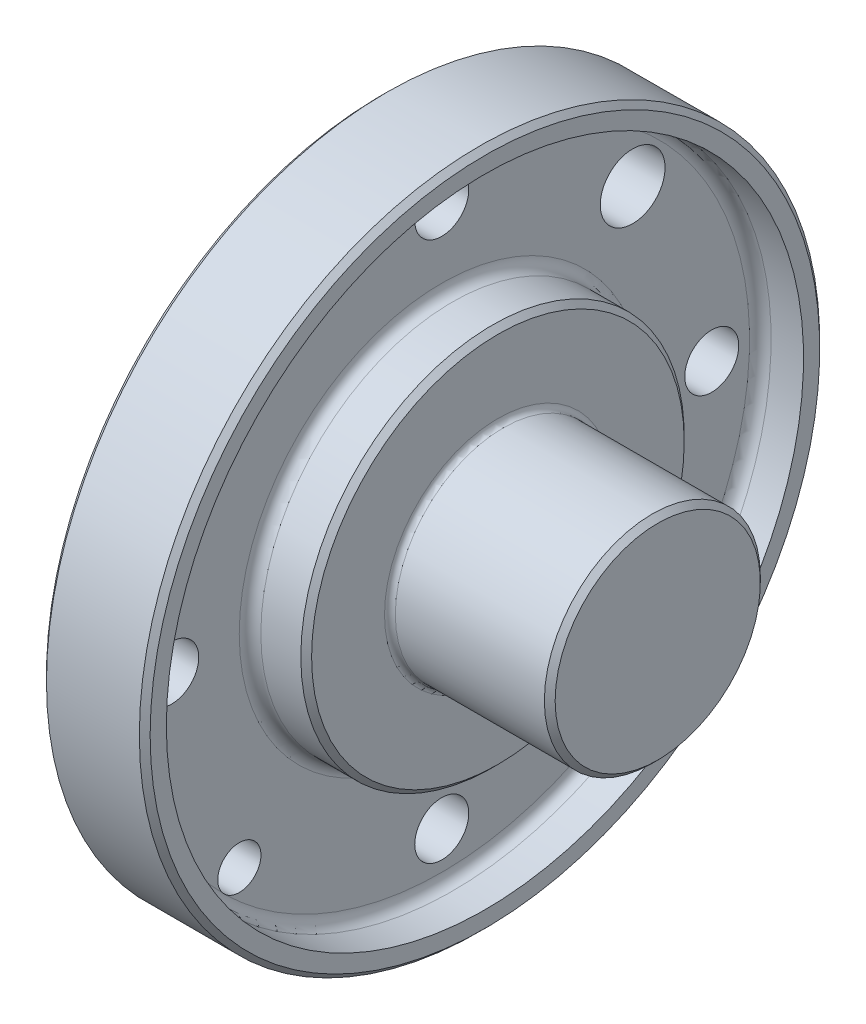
ISO-10303-21;
HEADER;
FILE_DESCRIPTION(('STEP AP214'),'2;1');
FILE_NAME('part.step','',(''),(''),'','','');
FILE_SCHEMA(('AUTOMOTIVE_DESIGN { 1 0 10303 214 1 1 1 1 }'));
ENDSEC;
DATA;
#1=APPLICATION_CONTEXT('core data for automotive mechanical design processes');
#2=APPLICATION_PROTOCOL_DEFINITION('international standard','automotive_design',2000,#1);
#3=PRODUCT_CONTEXT('',#1,'mechanical');
#4=PRODUCT('Part','Part','',(#3));
#5=PRODUCT_RELATED_PRODUCT_CATEGORY('part','',(#4));
#6=PRODUCT_DEFINITION_FORMATION('','',#4);
#7=PRODUCT_DEFINITION_CONTEXT('part definition',#1,'design');
#8=PRODUCT_DEFINITION('design','',#6,#7);
#9=PRODUCT_DEFINITION_SHAPE('','',#8);
#10=(LENGTH_UNIT() NAMED_UNIT(*) SI_UNIT(.MILLI.,.METRE.));
#11=(NAMED_UNIT(*) PLANE_ANGLE_UNIT() SI_UNIT($,.RADIAN.));
#12=(NAMED_UNIT(*) SI_UNIT($,.STERADIAN.) SOLID_ANGLE_UNIT());
#13=UNCERTAINTY_MEASURE_WITH_UNIT(LENGTH_MEASURE(1.E-05),#10,'distance_accuracy_value','');
#14=(GEOMETRIC_REPRESENTATION_CONTEXT(3) GLOBAL_UNCERTAINTY_ASSIGNED_CONTEXT((#13)) GLOBAL_UNIT_ASSIGNED_CONTEXT((#10,
#11,#12)) REPRESENTATION_CONTEXT('',''));
#15=CARTESIAN_POINT('',(0.,0.,0.));
#16=DIRECTION('',(0.,0.,1.));
#17=DIRECTION('',(1.,0.,0.));
#18=AXIS2_PLACEMENT_3D('',#15,#16,#17);
#19=CARTESIAN_POINT('',(5.6,29.5,0.));
#20=DIRECTION('',(-1.,0.,0.));
#21=DIRECTION('',(0.,0.,1.));
#22=AXIS2_PLACEMENT_3D('',#19,#20,#21);
#23=PLANE('',#22);
#24=CARTESIAN_POINT('',(5.6,2.61861100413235E-13,25.));
#25=DIRECTION('',(-1.,0.,0.));
#26=DIRECTION('',(0.,0.,1.));
#27=AXIS2_PLACEMENT_3D('',#24,#25,#26);
#28=CIRCLE('',#27,2.49999999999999);
#29=CARTESIAN_POINT('',(5.6,2.61861100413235E-13,27.5));
#30=VERTEX_POINT('',#29);
#31=EDGE_CURVE('E56',#30,#30,#28,.T.);
#32=ORIENTED_EDGE('',*,*,#31,.T.);
#33=EDGE_LOOP('',(#32));
#34=FACE_BOUND('',#33,.T.);
#35=CARTESIAN_POINT('',(5.6,-25.,0.));
#36=DIRECTION('',(-1.,0.,0.));
#37=DIRECTION('',(0.,0.,1.));
#38=AXIS2_PLACEMENT_3D('',#35,#36,#37);
#39=CIRCLE('',#38,2.49999999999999);
#40=CARTESIAN_POINT('',(5.6,-25.,2.49999999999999));
#41=VERTEX_POINT('',#40);
#42=EDGE_CURVE('E55',#41,#41,#39,.T.);
#43=ORIENTED_EDGE('',*,*,#42,.T.);
#44=EDGE_LOOP('',(#43));
#45=FACE_BOUND('',#44,.T.);
#46=CARTESIAN_POINT('',(5.6,0.,-25.));
#47=DIRECTION('',(-1.,0.,0.));
#48=DIRECTION('',(0.,0.,1.));
#49=AXIS2_PLACEMENT_3D('',#46,#47,#48);
#50=CIRCLE('',#49,2.49999999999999);
#51=CARTESIAN_POINT('',(5.6,0.,-22.5));
#52=VERTEX_POINT('',#51);
#53=EDGE_CURVE('E73',#52,#52,#50,.T.);
#54=ORIENTED_EDGE('',*,*,#53,.T.);
#55=EDGE_LOOP('',(#54));
#56=FACE_BOUND('',#55,.T.);
#57=CARTESIAN_POINT('',(5.6,25.,0.));
#58=DIRECTION('',(-1.,0.,0.));
#59=DIRECTION('',(0.,0.,1.));
#60=AXIS2_PLACEMENT_3D('',#57,#58,#59);
#61=CIRCLE('',#60,2.49999999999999);
#62=CARTESIAN_POINT('',(5.6,25.,2.49999999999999));
#63=VERTEX_POINT('',#62);
#64=EDGE_CURVE('E72',#63,#63,#61,.T.);
#65=ORIENTED_EDGE('',*,*,#64,.T.);
#66=EDGE_LOOP('',(#65));
#67=FACE_BOUND('',#66,.T.);
#68=CARTESIAN_POINT('',(5.6,17.6776695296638,-17.6776695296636));
#69=DIRECTION('',(-1.,0.,0.));
#70=DIRECTION('',(0.,0.,1.));
#71=AXIS2_PLACEMENT_3D('',#68,#69,#70);
#72=CIRCLE('',#71,3.);
#73=CARTESIAN_POINT('',(5.6,17.6776695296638,-14.6776695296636));
#74=VERTEX_POINT('',#73);
#75=EDGE_CURVE('E50',#74,#74,#72,.T.);
#76=ORIENTED_EDGE('',*,*,#75,.T.);
#77=EDGE_LOOP('',(#76));
#78=FACE_BOUND('',#77,.T.);
#79=CARTESIAN_POINT('',(5.6,0.,0.));
#80=DIRECTION('',(-1.,0.,0.));
#81=DIRECTION('',(0.,0.,1.));
#82=AXIS2_PLACEMENT_3D('',#79,#80,#81);
#83=CIRCLE('',#82,18.75);
#84=CARTESIAN_POINT('',(5.6,0.,18.75));
#85=VERTEX_POINT('',#84);
#86=EDGE_CURVE('E111',#85,#85,#83,.T.);
#87=ORIENTED_EDGE('',*,*,#86,.T.);
#88=EDGE_LOOP('',(#87));
#89=FACE_BOUND('',#88,.T.);
#90=CARTESIAN_POINT('',(5.6,0.,0.));
#91=DIRECTION('',(-1.,0.,0.));
#92=DIRECTION('',(0.,0.,1.));
#93=AXIS2_PLACEMENT_3D('',#90,#91,#92);
#94=CIRCLE('',#93,28.5);
#95=CARTESIAN_POINT('',(5.6,-20.1525432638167,20.1525432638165));
#96=VERTEX_POINT('',#95);
#97=EDGE_CURVE('E115',#96,#96,#94,.F.);
#98=ORIENTED_EDGE('',*,*,#97,.T.);
#99=CARTESIAN_POINT('',(5.6,-18.7383297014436,18.7383297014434));
#100=DIRECTION('',(-1.,0.,0.));
#101=DIRECTION('',(0.,0.,1.));
#102=AXIS2_PLACEMENT_3D('',#99,#100,#101);
#103=CIRCLE('',#102,2.00000000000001);
#104=EDGE_CURVE('E27',#96,#96,#103,.T.);
#105=ORIENTED_EDGE('',*,*,#104,.T.);
#106=EDGE_LOOP('',(#98,#105));
#107=FACE_BOUND('',#106,.T.);
#108=ADVANCED_FACE('F15',(#34,#45,#56,#67,#78,#89,#107),#23,.F.);
#109=CARTESIAN_POINT('',(0.,0.,0.));
#110=DIRECTION('',(1.,0.,0.));
#111=DIRECTION('',(0.,0.,-1.));
#112=AXIS2_PLACEMENT_3D('',#109,#110,#111);
#113=PLANE('',#112);
#114=CARTESIAN_POINT('',(0.,-25.,0.));
#115=DIRECTION('',(-1.,0.,0.));
#116=DIRECTION('',(0.,0.,1.));
#117=AXIS2_PLACEMENT_3D('',#114,#115,#116);
#118=CIRCLE('',#117,2.49999999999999);
#119=CARTESIAN_POINT('',(0.,-25.,2.49999999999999));
#120=VERTEX_POINT('',#119);
#121=EDGE_CURVE('E51',#120,#120,#118,.T.);
#122=ORIENTED_EDGE('',*,*,#121,.F.);
#123=EDGE_LOOP('',(#122));
#124=FACE_BOUND('',#123,.T.);
#125=CARTESIAN_POINT('',(0.,25.,0.));
#126=DIRECTION('',(-1.,0.,0.));
#127=DIRECTION('',(0.,0.,1.));
#128=AXIS2_PLACEMENT_3D('',#125,#126,#127);
#129=CIRCLE('',#128,2.49999999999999);
#130=CARTESIAN_POINT('',(0.,25.,2.49999999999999));
#131=VERTEX_POINT('',#130);
#132=EDGE_CURVE('E68',#131,#131,#129,.T.);
#133=ORIENTED_EDGE('',*,*,#132,.F.);
#134=EDGE_LOOP('',(#133));
#135=FACE_BOUND('',#134,.T.);
#136=CARTESIAN_POINT('',(0.,17.6776695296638,-17.6776695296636));
#137=DIRECTION('',(1.,0.,0.));
#138=DIRECTION('',(0.,0.,-1.));
#139=AXIS2_PLACEMENT_3D('',#136,#137,#138);
#140=CIRCLE('',#139,3.30000000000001);
#141=CARTESIAN_POINT('',(0.,17.6776695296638,-20.9776695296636));
#142=VERTEX_POINT('',#141);
#143=EDGE_CURVE('E620',#142,#142,#140,.T.);
#144=ORIENTED_EDGE('',*,*,#143,.T.);
#145=EDGE_LOOP('',(#144));
#146=FACE_BOUND('',#145,.T.);
#147=CARTESIAN_POINT('',(0.,-18.7383297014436,18.7383297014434));
#148=DIRECTION('',(1.,0.,0.));
#149=DIRECTION('',(0.,0.,-1.));
#150=AXIS2_PLACEMENT_3D('',#147,#148,#149);
#151=CIRCLE('',#150,2.30000000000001);
#152=CARTESIAN_POINT('',(0.,-18.7383297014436,16.4383297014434));
#153=VERTEX_POINT('',#152);
#154=EDGE_CURVE('E32',#153,#153,#151,.T.);
#155=ORIENTED_EDGE('',*,*,#154,.T.);
#156=EDGE_LOOP('',(#155));
#157=FACE_BOUND('',#156,.T.);
#158=CARTESIAN_POINT('',(0.,0.,0.));
#159=DIRECTION('',(1.,0.,0.));
#160=DIRECTION('',(0.,0.,-1.));
#161=AXIS2_PLACEMENT_3D('',#158,#159,#160);
#162=CIRCLE('',#161,16.25);
#163=CARTESIAN_POINT('',(0.,0.,-16.25));
#164=VERTEX_POINT('',#163);
#165=EDGE_CURVE('E77',#164,#164,#162,.T.);
#166=ORIENTED_EDGE('',*,*,#165,.T.);
#167=EDGE_LOOP('',(#166));
#168=FACE_BOUND('',#167,.T.);
#169=CARTESIAN_POINT('',(0.,0.,0.));
#170=DIRECTION('',(1.,0.,0.));
#171=DIRECTION('',(0.,0.,-1.));
#172=AXIS2_PLACEMENT_3D('',#169,#170,#171);
#173=CIRCLE('',#172,31.);
#174=CARTESIAN_POINT('',(0.,0.,-31.));
#175=VERTEX_POINT('',#174);
#176=EDGE_CURVE('E142',#175,#175,#173,.F.);
#177=ORIENTED_EDGE('',*,*,#176,.T.);
#178=EDGE_LOOP('',(#177));
#179=FACE_BOUND('',#178,.T.);
#180=CARTESIAN_POINT('',(0.,0.,-25.));
#181=DIRECTION('',(-1.,0.,0.));
#182=DIRECTION('',(0.,0.,1.));
#183=AXIS2_PLACEMENT_3D('',#180,#181,#182);
#184=CIRCLE('',#183,2.49999999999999);
#185=CARTESIAN_POINT('',(0.,0.,-22.5));
#186=VERTEX_POINT('',#185);
#187=EDGE_CURVE('E60',#186,#186,#184,.T.);
#188=ORIENTED_EDGE('',*,*,#187,.F.);
#189=EDGE_LOOP('',(#188));
#190=FACE_BOUND('',#189,.T.);
#191=CARTESIAN_POINT('',(0.,2.61861100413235E-13,25.));
#192=DIRECTION('',(-1.,0.,0.));
#193=DIRECTION('',(0.,0.,1.));
#194=AXIS2_PLACEMENT_3D('',#191,#192,#193);
#195=CIRCLE('',#194,2.49999999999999);
#196=CARTESIAN_POINT('',(0.,2.61861100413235E-13,27.5));
#197=VERTEX_POINT('',#196);
#198=EDGE_CURVE('E61',#197,#197,#195,.T.);
#199=ORIENTED_EDGE('',*,*,#198,.F.);
#200=EDGE_LOOP('',(#199));
#201=FACE_BOUND('',#200,.T.);
#202=ADVANCED_FACE('F171',(#124,#135,#146,#157,#168,#179,#190,#201),#113,.F.);
#203=CARTESIAN_POINT('',(0.,0.,0.));
#204=DIRECTION('',(-1.,0.,0.));
#205=DIRECTION('',(0.,0.,1.));
#206=AXIS2_PLACEMENT_3D('',#203,#204,#205);
#207=CYLINDRICAL_SURFACE('',#206,31.5);
#208=CARTESIAN_POINT('',(9.09999999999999,0.,0.));
#209=DIRECTION('',(-1.,0.,0.));
#210=DIRECTION('',(0.,0.,1.));
#211=AXIS2_PLACEMENT_3D('',#208,#209,#210);
#212=CIRCLE('',#211,31.5);
#213=CARTESIAN_POINT('',(9.09999999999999,0.,31.5));
#214=VERTEX_POINT('',#213);
#215=EDGE_CURVE('E134',#214,#214,#212,.T.);
#216=ORIENTED_EDGE('',*,*,#215,.T.);
#217=EDGE_LOOP('',(#216));
#218=FACE_BOUND('',#217,.T.);
#219=CARTESIAN_POINT('',(0.500000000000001,0.,0.));
#220=DIRECTION('',(1.,0.,0.));
#221=DIRECTION('',(0.,0.,-1.));
#222=AXIS2_PLACEMENT_3D('',#219,#220,#221);
#223=CIRCLE('',#222,31.5);
#224=CARTESIAN_POINT('',(0.500000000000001,0.,-31.5));
#225=VERTEX_POINT('',#224);
#226=EDGE_CURVE('E130',#225,#225,#223,.T.);
#227=ORIENTED_EDGE('',*,*,#226,.T.);
#228=EDGE_LOOP('',(#227));
#229=FACE_BOUND('',#228,.T.);
#230=ADVANCED_FACE('F177',(#218,#229),#207,.T.);
#231=CARTESIAN_POINT('',(9.6,29.5,0.));
#232=DIRECTION('',(-1.,0.,0.));
#233=DIRECTION('',(0.,0.,1.));
#234=AXIS2_PLACEMENT_3D('',#231,#232,#233);
#235=PLANE('',#234);
#236=CARTESIAN_POINT('',(9.6,0.,0.));
#237=DIRECTION('',(-1.,0.,0.));
#238=DIRECTION('',(0.,0.,1.));
#239=AXIS2_PLACEMENT_3D('',#236,#237,#238);
#240=CIRCLE('',#239,31.);
#241=CARTESIAN_POINT('',(9.6,0.,31.));
#242=VERTEX_POINT('',#241);
#243=EDGE_CURVE('E138',#242,#242,#240,.F.);
#244=ORIENTED_EDGE('',*,*,#243,.T.);
#245=EDGE_LOOP('',(#244));
#246=FACE_BOUND('',#245,.T.);
#247=CARTESIAN_POINT('',(9.6,0.,0.));
#248=DIRECTION('',(-1.,0.,0.));
#249=DIRECTION('',(0.,0.,1.));
#250=AXIS2_PLACEMENT_3D('',#247,#248,#249);
#251=CIRCLE('',#250,29.5);
#252=CARTESIAN_POINT('',(9.6,0.,29.5));
#253=VERTEX_POINT('',#252);
#254=EDGE_CURVE('E95',#253,#253,#251,.T.);
#255=ORIENTED_EDGE('',*,*,#254,.T.);
#256=EDGE_LOOP('',(#255));
#257=FACE_BOUND('',#256,.T.);
#258=ADVANCED_FACE('F188',(#246,#257),#235,.F.);
#259=CARTESIAN_POINT('',(0.,0.,0.));
#260=DIRECTION('',(-1.,0.,0.));
#261=DIRECTION('',(0.,0.,1.));
#262=AXIS2_PLACEMENT_3D('',#259,#260,#261);
#263=CYLINDRICAL_SURFACE('',#262,29.5);
#264=CARTESIAN_POINT('',(6.6,0.,0.));
#265=DIRECTION('',(-1.,0.,0.));
#266=DIRECTION('',(0.,0.,1.));
#267=AXIS2_PLACEMENT_3D('',#264,#265,#266);
#268=CIRCLE('',#267,29.5);
#269=CARTESIAN_POINT('',(6.6,0.,29.5));
#270=VERTEX_POINT('',#269);
#271=EDGE_CURVE('E107',#270,#270,#268,.T.);
#272=ORIENTED_EDGE('',*,*,#271,.T.);
#273=EDGE_LOOP('',(#272));
#274=FACE_BOUND('',#273,.T.);
#275=ORIENTED_EDGE('',*,*,#254,.F.);
#276=EDGE_LOOP('',(#275));
#277=FACE_BOUND('',#276,.T.);
#278=ADVANCED_FACE('F185',(#274,#277),#263,.F.);
#279=CARTESIAN_POINT('',(0.,0.,0.));
#280=DIRECTION('',(-1.,0.,0.));
#281=DIRECTION('',(0.,0.,1.));
#282=AXIS2_PLACEMENT_3D('',#279,#280,#281);
#283=CYLINDRICAL_SURFACE('',#282,17.75);
#284=CARTESIAN_POINT('',(10.3,0.,0.));
#285=DIRECTION('',(-1.,0.,0.));
#286=DIRECTION('',(0.,0.,1.));
#287=AXIS2_PLACEMENT_3D('',#284,#285,#286);
#288=CIRCLE('',#287,17.75);
#289=CARTESIAN_POINT('',(10.3,0.,17.75));
#290=VERTEX_POINT('',#289);
#291=EDGE_CURVE('E122',#290,#290,#288,.T.);
#292=ORIENTED_EDGE('',*,*,#291,.T.);
#293=EDGE_LOOP('',(#292));
#294=FACE_BOUND('',#293,.T.);
#295=CARTESIAN_POINT('',(6.6,0.,0.));
#296=DIRECTION('',(-1.,0.,0.));
#297=DIRECTION('',(0.,0.,1.));
#298=AXIS2_PLACEMENT_3D('',#295,#296,#297);
#299=CIRCLE('',#298,17.75);
#300=CARTESIAN_POINT('',(6.6,0.,17.75));
#301=VERTEX_POINT('',#300);
#302=EDGE_CURVE('E118',#301,#301,#299,.F.);
#303=ORIENTED_EDGE('',*,*,#302,.T.);
#304=EDGE_LOOP('',(#303));
#305=FACE_BOUND('',#304,.T.);
#306=ADVANCED_FACE('F183',(#294,#305),#283,.T.);
#307=CARTESIAN_POINT('',(10.8,17.75,0.));
#308=DIRECTION('',(-1.,0.,0.));
#309=DIRECTION('',(0.,0.,1.));
#310=AXIS2_PLACEMENT_3D('',#307,#308,#309);
#311=PLANE('',#310);
#312=CARTESIAN_POINT('',(10.8,0.,0.));
#313=DIRECTION('',(-1.,0.,0.));
#314=DIRECTION('',(0.,0.,1.));
#315=AXIS2_PLACEMENT_3D('',#312,#313,#314);
#316=CIRCLE('',#315,10.5);
#317=CARTESIAN_POINT('',(10.8,0.,10.5));
#318=VERTEX_POINT('',#317);
#319=EDGE_CURVE('E23',#318,#318,#316,.T.);
#320=ORIENTED_EDGE('',*,*,#319,.T.);
#321=EDGE_LOOP('',(#320));
#322=FACE_BOUND('',#321,.T.);
#323=CARTESIAN_POINT('',(10.8,0.,0.));
#324=DIRECTION('',(-1.,0.,0.));
#325=DIRECTION('',(0.,0.,1.));
#326=AXIS2_PLACEMENT_3D('',#323,#324,#325);
#327=CIRCLE('',#326,17.25);
#328=CARTESIAN_POINT('',(10.8,0.,17.25));
#329=VERTEX_POINT('',#328);
#330=EDGE_CURVE('E126',#329,#329,#327,.F.);
#331=ORIENTED_EDGE('',*,*,#330,.T.);
#332=EDGE_LOOP('',(#331));
#333=FACE_BOUND('',#332,.T.);
#334=ADVANCED_FACE('F152',(#322,#333),#311,.F.);
#335=CARTESIAN_POINT('',(0.,0.,0.));
#336=DIRECTION('',(-1.,0.,0.));
#337=DIRECTION('',(0.,0.,1.));
#338=AXIS2_PLACEMENT_3D('',#335,#336,#337);
#339=CYLINDRICAL_SURFACE('',#338,10.);
#340=CARTESIAN_POINT('',(11.3,0.,0.));
#341=DIRECTION('',(-1.,0.,0.));
#342=DIRECTION('',(0.,0.,1.));
#343=AXIS2_PLACEMENT_3D('',#340,#341,#342);
#344=CIRCLE('',#343,10.);
#345=CARTESIAN_POINT('',(11.3,0.,10.));
#346=VERTEX_POINT('',#345);
#347=EDGE_CURVE('E9',#346,#346,#344,.F.);
#348=ORIENTED_EDGE('',*,*,#347,.T.);
#349=EDGE_LOOP('',(#348));
#350=FACE_BOUND('',#349,.T.);
#351=CARTESIAN_POINT('',(25.1,0.,0.));
#352=DIRECTION('',(-1.,0.,0.));
#353=DIRECTION('',(0.,0.,1.));
#354=AXIS2_PLACEMENT_3D('',#351,#352,#353);
#355=CIRCLE('',#354,10.);
#356=CARTESIAN_POINT('',(25.1,0.,10.));
#357=VERTEX_POINT('',#356);
#358=EDGE_CURVE('E99',#357,#357,#355,.T.);
#359=ORIENTED_EDGE('',*,*,#358,.T.);
#360=EDGE_LOOP('',(#359));
#361=FACE_BOUND('',#360,.T.);
#362=ADVANCED_FACE('F262',(#350,#361),#339,.T.);
#363=CARTESIAN_POINT('',(25.6,10.,0.));
#364=DIRECTION('',(-1.,0.,0.));
#365=DIRECTION('',(0.,0.,1.));
#366=AXIS2_PLACEMENT_3D('',#363,#364,#365);
#367=PLANE('',#366);
#368=CARTESIAN_POINT('',(25.6,0.,0.));
#369=DIRECTION('',(-1.,0.,0.));
#370=DIRECTION('',(0.,0.,1.));
#371=AXIS2_PLACEMENT_3D('',#368,#369,#370);
#372=CIRCLE('',#371,9.50000000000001);
#373=CARTESIAN_POINT('',(25.6,0.,9.50000000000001));
#374=VERTEX_POINT('',#373);
#375=EDGE_CURVE('E103',#374,#374,#372,.F.);
#376=ORIENTED_EDGE('',*,*,#375,.T.);
#377=EDGE_LOOP('',(#376));
#378=FACE_BOUND('',#377,.T.);
#379=ADVANCED_FACE('F200',(#378),#367,.F.);
#380=CARTESIAN_POINT('',(25.1,0.,0.));
#381=DIRECTION('',(-1.,0.,0.));
#382=DIRECTION('',(0.,0.,1.));
#383=AXIS2_PLACEMENT_3D('',#380,#381,#382);
#384=CONICAL_SURFACE('',#383,10.,0.785398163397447);
#385=ORIENTED_EDGE('',*,*,#375,.F.);
#386=EDGE_LOOP('',(#385));
#387=FACE_BOUND('',#386,.T.);
#388=ORIENTED_EDGE('',*,*,#358,.F.);
#389=EDGE_LOOP('',(#388));
#390=FACE_BOUND('',#389,.T.);
#391=ADVANCED_FACE('F196',(#387,#390),#384,.T.);
#392=CARTESIAN_POINT('',(6.6,0.,0.));
#393=DIRECTION('',(-1.,0.,0.));
#394=DIRECTION('',(0.,0.,1.));
#395=AXIS2_PLACEMENT_3D('',#392,#393,#394);
#396=TOROIDAL_SURFACE('',#395,28.5,1.);
#397=ORIENTED_EDGE('',*,*,#97,.F.);
#398=EDGE_LOOP('',(#397));
#399=FACE_BOUND('',#398,.T.);
#400=ORIENTED_EDGE('',*,*,#271,.F.);
#401=EDGE_LOOP('',(#400));
#402=FACE_BOUND('',#401,.T.);
#403=ADVANCED_FACE('F199',(#399,#402),#396,.F.);
#404=CARTESIAN_POINT('',(6.6,0.,0.));
#405=DIRECTION('',(-1.,0.,0.));
#406=DIRECTION('',(0.,0.,1.));
#407=AXIS2_PLACEMENT_3D('',#404,#405,#406);
#408=TOROIDAL_SURFACE('',#407,18.75,1.);
#409=ORIENTED_EDGE('',*,*,#302,.F.);
#410=EDGE_LOOP('',(#409));
#411=FACE_BOUND('',#410,.T.);
#412=ORIENTED_EDGE('',*,*,#86,.F.);
#413=EDGE_LOOP('',(#412));
#414=FACE_BOUND('',#413,.T.);
#415=ADVANCED_FACE('F204',(#411,#414),#408,.F.);
#416=CARTESIAN_POINT('',(10.3,0.,0.));
#417=DIRECTION('',(-1.,0.,0.));
#418=DIRECTION('',(0.,0.,1.));
#419=AXIS2_PLACEMENT_3D('',#416,#417,#418);
#420=CONICAL_SURFACE('',#419,17.75,0.785398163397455);
#421=ORIENTED_EDGE('',*,*,#330,.F.);
#422=EDGE_LOOP('',(#421));
#423=FACE_BOUND('',#422,.T.);
#424=ORIENTED_EDGE('',*,*,#291,.F.);
#425=EDGE_LOOP('',(#424));
#426=FACE_BOUND('',#425,.T.);
#427=ADVANCED_FACE('F208',(#423,#426),#420,.T.);
#428=CARTESIAN_POINT('',(9.09999999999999,0.,0.));
#429=DIRECTION('',(-1.,0.,0.));
#430=DIRECTION('',(0.,0.,1.));
#431=AXIS2_PLACEMENT_3D('',#428,#429,#430);
#432=CONICAL_SURFACE('',#431,31.5,0.785398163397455);
#433=ORIENTED_EDGE('',*,*,#243,.F.);
#434=EDGE_LOOP('',(#433));
#435=FACE_BOUND('',#434,.T.);
#436=ORIENTED_EDGE('',*,*,#215,.F.);
#437=EDGE_LOOP('',(#436));
#438=FACE_BOUND('',#437,.T.);
#439=ADVANCED_FACE('F167',(#435,#438),#432,.T.);
#440=CARTESIAN_POINT('',(0.,0.,0.));
#441=DIRECTION('',(1.,0.,0.));
#442=DIRECTION('',(0.,0.,-1.));
#443=AXIS2_PLACEMENT_3D('',#440,#441,#442);
#444=CONICAL_SURFACE('',#443,31.,0.785398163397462);
#445=ORIENTED_EDGE('',*,*,#226,.F.);
#446=EDGE_LOOP('',(#445));
#447=FACE_BOUND('',#446,.T.);
#448=ORIENTED_EDGE('',*,*,#176,.F.);
#449=EDGE_LOOP('',(#448));
#450=FACE_BOUND('',#449,.T.);
#451=ADVANCED_FACE('F157',(#447,#450),#444,.T.);
#452=CARTESIAN_POINT('',(11.3,0.,0.));
#453=DIRECTION('',(-1.,0.,0.));
#454=DIRECTION('',(0.,0.,1.));
#455=AXIS2_PLACEMENT_3D('',#452,#453,#454);
#456=TOROIDAL_SURFACE('',#455,10.5,0.5);
#457=ORIENTED_EDGE('',*,*,#347,.F.);
#458=EDGE_LOOP('',(#457));
#459=FACE_BOUND('',#458,.T.);
#460=ORIENTED_EDGE('',*,*,#319,.F.);
#461=EDGE_LOOP('',(#460));
#462=FACE_BOUND('',#461,.T.);
#463=ADVANCED_FACE('F17',(#459,#462),#456,.F.);
#464=CARTESIAN_POINT('',(0.5,0.,0.));
#465=DIRECTION('',(-1.,0.,0.));
#466=DIRECTION('',(0.,0.,1.));
#467=AXIS2_PLACEMENT_3D('',#464,#465,#466);
#468=CONICAL_SURFACE('',#467,15.75,0.785398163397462);
#469=ORIENTED_EDGE('',*,*,#165,.F.);
#470=EDGE_LOOP('',(#469));
#471=FACE_BOUND('',#470,.T.);
#472=CARTESIAN_POINT('',(0.5,0.,0.));
#473=DIRECTION('',(1.,0.,0.));
#474=DIRECTION('',(0.,0.,-1.));
#475=AXIS2_PLACEMENT_3D('',#472,#473,#474);
#476=CIRCLE('',#475,15.75);
#477=CARTESIAN_POINT('',(0.5,0.,-15.75));
#478=VERTEX_POINT('',#477);
#479=EDGE_CURVE('E91',#478,#478,#476,.F.);
#480=ORIENTED_EDGE('',*,*,#479,.F.);
#481=EDGE_LOOP('',(#480));
#482=FACE_BOUND('',#481,.T.);
#483=ADVANCED_FACE('F156',(#471,#482),#468,.F.);
#484=CARTESIAN_POINT('',(4.,0.,0.));
#485=DIRECTION('',(-1.,0.,0.));
#486=DIRECTION('',(0.,0.,1.));
#487=AXIS2_PLACEMENT_3D('',#484,#485,#486);
#488=CYLINDRICAL_SURFACE('',#487,15.75);
#489=ORIENTED_EDGE('',*,*,#479,.T.);
#490=EDGE_LOOP('',(#489));
#491=FACE_BOUND('',#490,.T.);
#492=CARTESIAN_POINT('',(4.,0.,0.));
#493=DIRECTION('',(-1.,0.,0.));
#494=DIRECTION('',(0.,0.,1.));
#495=AXIS2_PLACEMENT_3D('',#492,#493,#494);
#496=CIRCLE('',#495,15.75);
#497=CARTESIAN_POINT('',(4.,0.,15.75));
#498=VERTEX_POINT('',#497);
#499=EDGE_CURVE('E87',#498,#498,#496,.T.);
#500=ORIENTED_EDGE('',*,*,#499,.F.);
#501=EDGE_LOOP('',(#500));
#502=FACE_BOUND('',#501,.T.);
#503=ADVANCED_FACE('F164',(#491,#502),#488,.F.);
#504=CARTESIAN_POINT('',(4.,0.,0.));
#505=DIRECTION('',(-1.,0.,0.));
#506=DIRECTION('',(0.,0.,1.));
#507=AXIS2_PLACEMENT_3D('',#504,#505,#506);
#508=PLANE('',#507);
#509=ORIENTED_EDGE('',*,*,#499,.T.);
#510=EDGE_LOOP('',(#509));
#511=FACE_BOUND('',#510,.T.);
#512=ADVANCED_FACE('F252',(#511),#508,.T.);
#513=CARTESIAN_POINT('',(0.299999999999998,-18.7383297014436,18.7383297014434));
#514=DIRECTION('',(-1.,0.,0.));
#515=DIRECTION('',(0.,0.,1.));
#516=AXIS2_PLACEMENT_3D('',#513,#514,#515);
#517=CONICAL_SURFACE('',#516,2.00000000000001,0.785398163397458);
#518=ORIENTED_EDGE('',*,*,#154,.F.);
#519=EDGE_LOOP('',(#518));
#520=FACE_BOUND('',#519,.T.);
#521=CARTESIAN_POINT('',(0.299999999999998,-18.7383297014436,18.7383297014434));
#522=DIRECTION('',(1.,0.,0.));
#523=DIRECTION('',(0.,0.,-1.));
#524=AXIS2_PLACEMENT_3D('',#521,#522,#523);
#525=CIRCLE('',#524,2.00000000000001);
#526=CARTESIAN_POINT('',(0.299999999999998,-18.7383297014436,16.7383297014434));
#527=VERTEX_POINT('',#526);
#528=EDGE_CURVE('E41',#527,#527,#525,.F.);
#529=ORIENTED_EDGE('',*,*,#528,.F.);
#530=EDGE_LOOP('',(#529));
#531=FACE_BOUND('',#530,.T.);
#532=ADVANCED_FACE('F255',(#520,#531),#517,.F.);
#533=CARTESIAN_POINT('',(25.6,-18.7383297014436,18.7383297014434));
#534=DIRECTION('',(-1.,0.,0.));
#535=DIRECTION('',(0.,0.,1.));
#536=AXIS2_PLACEMENT_3D('',#533,#534,#535);
#537=CYLINDRICAL_SURFACE('',#536,2.00000000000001);
#538=ORIENTED_EDGE('',*,*,#528,.T.);
#539=EDGE_LOOP('',(#538));
#540=FACE_BOUND('',#539,.T.);
#541=ORIENTED_EDGE('',*,*,#104,.F.);
#542=EDGE_LOOP('',(#541));
#543=FACE_BOUND('',#542,.T.);
#544=ADVANCED_FACE('F28',(#540,#543),#537,.F.);
#545=CARTESIAN_POINT('',(0.300000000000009,17.6776695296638,-17.6776695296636));
#546=DIRECTION('',(-1.,0.,0.));
#547=DIRECTION('',(0.,0.,1.));
#548=AXIS2_PLACEMENT_3D('',#545,#546,#547);
#549=CONICAL_SURFACE('',#548,3.,0.785398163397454);
#550=ORIENTED_EDGE('',*,*,#143,.F.);
#551=EDGE_LOOP('',(#550));
#552=FACE_BOUND('',#551,.T.);
#553=CARTESIAN_POINT('',(0.300000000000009,17.6776695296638,-17.6776695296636));
#554=DIRECTION('',(1.,0.,0.));
#555=DIRECTION('',(0.,0.,-1.));
#556=AXIS2_PLACEMENT_3D('',#553,#554,#555);
#557=CIRCLE('',#556,3.);
#558=CARTESIAN_POINT('',(0.300000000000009,17.6776695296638,-20.6776695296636));
#559=VERTEX_POINT('',#558);
#560=EDGE_CURVE('E44',#559,#559,#557,.F.);
#561=ORIENTED_EDGE('',*,*,#560,.F.);
#562=EDGE_LOOP('',(#561));
#563=FACE_BOUND('',#562,.T.);
#564=ADVANCED_FACE('F499',(#552,#563),#549,.F.);
#565=CARTESIAN_POINT('',(0.,17.6776695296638,-17.6776695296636));
#566=DIRECTION('',(-1.,0.,0.));
#567=DIRECTION('',(0.,0.,1.));
#568=AXIS2_PLACEMENT_3D('',#565,#566,#567);
#569=CYLINDRICAL_SURFACE('',#568,3.);
#570=ORIENTED_EDGE('',*,*,#560,.T.);
#571=EDGE_LOOP('',(#570));
#572=FACE_BOUND('',#571,.T.);
#573=ORIENTED_EDGE('',*,*,#75,.F.);
#574=EDGE_LOOP('',(#573));
#575=FACE_BOUND('',#574,.T.);
#576=ADVANCED_FACE('F247',(#572,#575),#569,.F.);
#577=CARTESIAN_POINT('',(0.,25.,0.));
#578=DIRECTION('',(-1.,0.,0.));
#579=DIRECTION('',(0.,0.,1.));
#580=AXIS2_PLACEMENT_3D('',#577,#578,#579);
#581=CYLINDRICAL_SURFACE('',#580,2.49999999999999);
#582=ORIENTED_EDGE('',*,*,#132,.T.);
#583=EDGE_LOOP('',(#582));
#584=FACE_BOUND('',#583,.T.);
#585=ORIENTED_EDGE('',*,*,#64,.F.);
#586=EDGE_LOOP('',(#585));
#587=FACE_BOUND('',#586,.T.);
#588=ADVANCED_FACE('F244',(#584,#587),#581,.F.);
#589=CARTESIAN_POINT('',(0.,0.,-25.));
#590=DIRECTION('',(-1.,0.,0.));
#591=DIRECTION('',(0.,0.,1.));
#592=AXIS2_PLACEMENT_3D('',#589,#590,#591);
#593=CYLINDRICAL_SURFACE('',#592,2.49999999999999);
#594=ORIENTED_EDGE('',*,*,#187,.T.);
#595=EDGE_LOOP('',(#594));
#596=FACE_BOUND('',#595,.T.);
#597=ORIENTED_EDGE('',*,*,#53,.F.);
#598=EDGE_LOOP('',(#597));
#599=FACE_BOUND('',#598,.T.);
#600=ADVANCED_FACE('F239',(#596,#599),#593,.F.);
#601=CARTESIAN_POINT('',(0.,-25.,0.));
#602=DIRECTION('',(-1.,0.,0.));
#603=DIRECTION('',(0.,0.,1.));
#604=AXIS2_PLACEMENT_3D('',#601,#602,#603);
#605=CYLINDRICAL_SURFACE('',#604,2.49999999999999);
#606=ORIENTED_EDGE('',*,*,#121,.T.);
#607=EDGE_LOOP('',(#606));
#608=FACE_BOUND('',#607,.T.);
#609=ORIENTED_EDGE('',*,*,#42,.F.);
#610=EDGE_LOOP('',(#609));
#611=FACE_BOUND('',#610,.T.);
#612=ADVANCED_FACE('F233',(#608,#611),#605,.F.);
#613=CARTESIAN_POINT('',(0.,2.61861100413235E-13,25.));
#614=DIRECTION('',(-1.,0.,0.));
#615=DIRECTION('',(0.,0.,1.));
#616=AXIS2_PLACEMENT_3D('',#613,#614,#615);
#617=CYLINDRICAL_SURFACE('',#616,2.49999999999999);
#618=ORIENTED_EDGE('',*,*,#198,.T.);
#619=EDGE_LOOP('',(#618));
#620=FACE_BOUND('',#619,.T.);
#621=ORIENTED_EDGE('',*,*,#31,.F.);
#622=EDGE_LOOP('',(#621));
#623=FACE_BOUND('',#622,.T.);
#624=ADVANCED_FACE('F230',(#620,#623),#617,.F.);
#625=CLOSED_SHELL('',(#108,#202,#230,#258,#278,#306,#334,#362,#379,#391,#403,#415,#427,#439,
#451,#463,#483,#503,#512,#532,#544,#564,#576,#588,#600,#612,#624));
#626=MANIFOLD_SOLID_BREP('B1',#625);
#627=ADVANCED_BREP_SHAPE_REPRESENTATION('',(#18,#626),#14);
#628=SHAPE_DEFINITION_REPRESENTATION(#9,#627);
ENDSEC;
END-ISO-10303-21;
